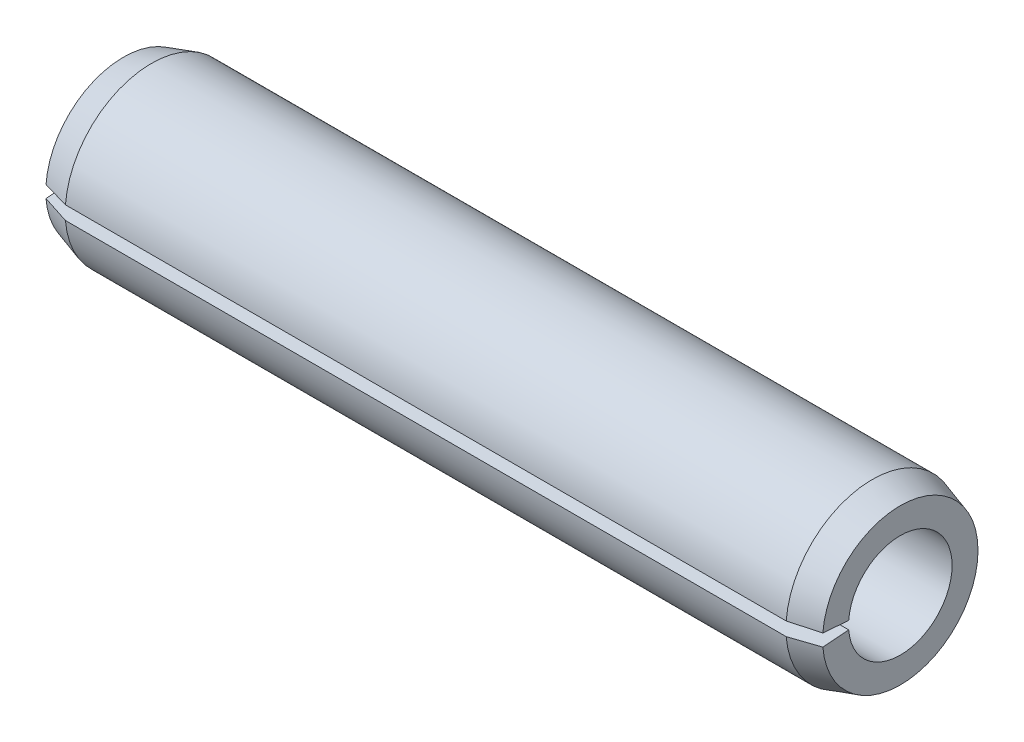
ISO-10303-21;
HEADER;
FILE_DESCRIPTION(('STEP AP214'),'2;1');
FILE_NAME('part.step','',(''),(''),'','','');
FILE_SCHEMA(('AUTOMOTIVE_DESIGN { 1 0 10303 214 1 1 1 1 }'));
ENDSEC;
DATA;
#1=APPLICATION_CONTEXT('core data for automotive mechanical design processes');
#2=APPLICATION_PROTOCOL_DEFINITION('international standard','automotive_design',2000,#1);
#3=PRODUCT_CONTEXT('',#1,'mechanical');
#4=PRODUCT('Part','Part','',(#3));
#5=PRODUCT_RELATED_PRODUCT_CATEGORY('part','',(#4));
#6=PRODUCT_DEFINITION_FORMATION('','',#4);
#7=PRODUCT_DEFINITION_CONTEXT('part definition',#1,'design');
#8=PRODUCT_DEFINITION('design','',#6,#7);
#9=PRODUCT_DEFINITION_SHAPE('','',#8);
#10=(LENGTH_UNIT() NAMED_UNIT(*) SI_UNIT(.MILLI.,.METRE.));
#11=(NAMED_UNIT(*) PLANE_ANGLE_UNIT() SI_UNIT($,.RADIAN.));
#12=(NAMED_UNIT(*) SI_UNIT($,.STERADIAN.) SOLID_ANGLE_UNIT());
#13=UNCERTAINTY_MEASURE_WITH_UNIT(LENGTH_MEASURE(1.E-05),#10,'distance_accuracy_value','');
#14=(GEOMETRIC_REPRESENTATION_CONTEXT(3) GLOBAL_UNCERTAINTY_ASSIGNED_CONTEXT((#13)) GLOBAL_UNIT_ASSIGNED_CONTEXT((#10,
#11,#12)) REPRESENTATION_CONTEXT('',''));
#15=CARTESIAN_POINT('',(0.,0.,0.));
#16=DIRECTION('',(0.,0.,1.));
#17=DIRECTION('',(1.,0.,0.));
#18=AXIS2_PLACEMENT_3D('',#15,#16,#17);
#19=CARTESIAN_POINT('',(0.,1.8,0.));
#20=DIRECTION('',(1.,0.,0.));
#21=DIRECTION('',(0.,0.,-1.));
#22=AXIS2_PLACEMENT_3D('',#19,#20,#21);
#23=PLANE('',#22);
#24=DIRECTION('',(0.,0.0784590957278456,0.996917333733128));
#25=VECTOR('',#24,1.);
#26=CARTESIAN_POINT('',(0.,0.,0.));
#27=LINE('',#26,#25);
#28=CARTESIAN_POINT('',(0.,0.0941509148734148,1.19630080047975));
#29=VERTEX_POINT('',#28);
#30=CARTESIAN_POINT('',(0.,0.141226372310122,1.79445120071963));
#31=VERTEX_POINT('',#30);
#32=EDGE_CURVE('E81',#29,#31,#27,.T.);
#33=ORIENTED_EDGE('',*,*,#32,.T.);
#34=CARTESIAN_POINT('',(0.,0.,0.));
#35=DIRECTION('',(-1.,0.,0.));
#36=DIRECTION('',(0.,0.,1.));
#37=AXIS2_PLACEMENT_3D('',#34,#35,#36);
#38=CIRCLE('',#37,1.8);
#39=CARTESIAN_POINT('',(0.,-0.141226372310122,1.79445120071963));
#40=VERTEX_POINT('',#39);
#41=EDGE_CURVE('E99',#31,#40,#38,.T.);
#42=ORIENTED_EDGE('',*,*,#41,.T.);
#43=DIRECTION('',(0.,-0.0784590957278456,0.996917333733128));
#44=VECTOR('',#43,1.);
#45=CARTESIAN_POINT('',(0.,0.,0.));
#46=LINE('',#45,#44);
#47=CARTESIAN_POINT('',(0.,-0.0941509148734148,1.19630080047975));
#48=VERTEX_POINT('',#47);
#49=EDGE_CURVE('E53',#48,#40,#46,.T.);
#50=ORIENTED_EDGE('',*,*,#49,.F.);
#51=CARTESIAN_POINT('',(0.,0.,0.));
#52=DIRECTION('',(-1.,0.,0.));
#53=DIRECTION('',(0.,0.,1.));
#54=AXIS2_PLACEMENT_3D('',#51,#52,#53);
#55=CIRCLE('',#54,1.2);
#56=EDGE_CURVE('E96',#29,#48,#55,.T.);
#57=ORIENTED_EDGE('',*,*,#56,.F.);
#58=EDGE_LOOP('',(#33,#42,#50,#57));
#59=FACE_BOUND('',#58,.T.);
#60=ADVANCED_FACE('F32',(#59),#23,.F.);
#61=CARTESIAN_POINT('',(-9.52499999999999,0.,0.));
#62=DIRECTION('',(-1.,0.,0.));
#63=DIRECTION('',(0.,0.,1.));
#64=AXIS2_PLACEMENT_3D('',#61,#62,#63);
#65=CYLINDRICAL_SURFACE('',#64,1.2);
#66=DIRECTION('',(-1.,0.,0.));
#67=VECTOR('',#66,1.);
#68=CARTESIAN_POINT('',(-9.52499999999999,0.0941509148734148,1.19630080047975));
#69=LINE('',#68,#67);
#70=CARTESIAN_POINT('',(18.,0.0941509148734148,1.19630080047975));
#71=VERTEX_POINT('',#70);
#72=EDGE_CURVE('E84',#29,#71,#69,.F.);
#73=ORIENTED_EDGE('',*,*,#72,.F.);
#74=ORIENTED_EDGE('',*,*,#56,.T.);
#75=DIRECTION('',(-1.,0.,0.));
#76=VECTOR('',#75,1.);
#77=CARTESIAN_POINT('',(-9.52499999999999,-0.0941509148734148,1.19630080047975));
#78=LINE('',#77,#76);
#79=CARTESIAN_POINT('',(18.,-0.0941509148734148,1.19630080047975));
#80=VERTEX_POINT('',#79);
#81=EDGE_CURVE('E117',#48,#80,#78,.F.);
#82=ORIENTED_EDGE('',*,*,#81,.T.);
#83=CARTESIAN_POINT('',(18.,0.,0.));
#84=DIRECTION('',(-1.,0.,0.));
#85=DIRECTION('',(0.,0.,1.));
#86=AXIS2_PLACEMENT_3D('',#83,#84,#85);
#87=CIRCLE('',#86,1.2);
#88=EDGE_CURVE('E98',#71,#80,#87,.T.);
#89=ORIENTED_EDGE('',*,*,#88,.F.);
#90=EDGE_LOOP('',(#73,#74,#82,#89));
#91=FACE_BOUND('',#90,.T.);
#92=ADVANCED_FACE('F94',(#91),#65,.F.);
#93=CARTESIAN_POINT('',(18.,1.2,0.));
#94=DIRECTION('',(-1.,0.,0.));
#95=DIRECTION('',(0.,0.,1.));
#96=AXIS2_PLACEMENT_3D('',#93,#94,#95);
#97=PLANE('',#96);
#98=DIRECTION('',(0.,0.0784590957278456,0.996917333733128));
#99=VECTOR('',#98,1.);
#100=CARTESIAN_POINT('',(18.,0.,0.));
#101=LINE('',#100,#99);
#102=CARTESIAN_POINT('',(18.,0.141226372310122,1.79445120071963));
#103=VERTEX_POINT('',#102);
#104=EDGE_CURVE('E126',#71,#103,#101,.T.);
#105=ORIENTED_EDGE('',*,*,#104,.F.);
#106=ORIENTED_EDGE('',*,*,#88,.T.);
#107=DIRECTION('',(0.,-0.0784590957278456,0.996917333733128));
#108=VECTOR('',#107,1.);
#109=CARTESIAN_POINT('',(18.,0.,0.));
#110=LINE('',#109,#108);
#111=CARTESIAN_POINT('',(18.,-0.141226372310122,1.79445120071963));
#112=VERTEX_POINT('',#111);
#113=EDGE_CURVE('E125',#80,#112,#110,.T.);
#114=ORIENTED_EDGE('',*,*,#113,.T.);
#115=CARTESIAN_POINT('',(18.,0.,0.));
#116=DIRECTION('',(-1.,0.,0.));
#117=DIRECTION('',(0.,0.,1.));
#118=AXIS2_PLACEMENT_3D('',#115,#116,#117);
#119=CIRCLE('',#118,1.8);
#120=EDGE_CURVE('E103',#103,#112,#119,.T.);
#121=ORIENTED_EDGE('',*,*,#120,.F.);
#122=EDGE_LOOP('',(#105,#106,#114,#121));
#123=FACE_BOUND('',#122,.T.);
#124=ADVANCED_FACE('F136',(#123),#97,.F.);
#125=CARTESIAN_POINT('',(18.,0.,0.));
#126=DIRECTION('',(-1.,0.,0.));
#127=DIRECTION('',(0.,0.,1.));
#128=AXIS2_PLACEMENT_3D('',#125,#126,#127);
#129=CONICAL_SURFACE('',#128,1.8,0.29849893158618);
#130=DIRECTION('',(-0.95577900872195,0.0230737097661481,0.293179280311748));
#131=VECTOR('',#130,1.);
#132=CARTESIAN_POINT('',(23.85,0.,0.));
#133=LINE('',#132,#131);
#134=CARTESIAN_POINT('',(17.35,0.156918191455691,1.99383466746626));
#135=VERTEX_POINT('',#134);
#136=EDGE_CURVE('E100',#103,#135,#133,.T.);
#137=ORIENTED_EDGE('',*,*,#136,.F.);
#138=ORIENTED_EDGE('',*,*,#120,.T.);
#139=DIRECTION('',(-0.95577900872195,-0.0230737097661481,0.293179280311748));
#140=VECTOR('',#139,1.);
#141=CARTESIAN_POINT('',(23.85,0.,0.));
#142=LINE('',#141,#140);
#143=CARTESIAN_POINT('',(17.35,-0.156918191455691,1.99383466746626));
#144=VERTEX_POINT('',#143);
#145=EDGE_CURVE('E119',#112,#144,#142,.T.);
#146=ORIENTED_EDGE('',*,*,#145,.T.);
#147=CARTESIAN_POINT('',(17.35,0.,0.));
#148=DIRECTION('',(-1.,0.,0.));
#149=DIRECTION('',(0.,0.,1.));
#150=AXIS2_PLACEMENT_3D('',#147,#148,#149);
#151=CIRCLE('',#150,2.);
#152=EDGE_CURVE('E108',#135,#144,#151,.T.);
#153=ORIENTED_EDGE('',*,*,#152,.F.);
#154=EDGE_LOOP('',(#137,#138,#146,#153));
#155=FACE_BOUND('',#154,.T.);
#156=ADVANCED_FACE('F135',(#155),#129,.T.);
#157=CARTESIAN_POINT('',(-9.52499999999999,0.,0.));
#158=DIRECTION('',(-1.,0.,0.));
#159=DIRECTION('',(0.,0.,1.));
#160=AXIS2_PLACEMENT_3D('',#157,#158,#159);
#161=CYLINDRICAL_SURFACE('',#160,2.);
#162=DIRECTION('',(-1.,0.,0.));
#163=VECTOR('',#162,1.);
#164=CARTESIAN_POINT('',(-9.52499999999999,0.156918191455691,1.99383466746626));
#165=LINE('',#164,#163);
#166=CARTESIAN_POINT('',(0.65,0.156918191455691,1.99383466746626));
#167=VERTEX_POINT('',#166);
#168=EDGE_CURVE('E45',#135,#167,#165,.T.);
#169=ORIENTED_EDGE('',*,*,#168,.F.);
#170=ORIENTED_EDGE('',*,*,#152,.T.);
#171=DIRECTION('',(-1.,0.,0.));
#172=VECTOR('',#171,1.);
#173=CARTESIAN_POINT('',(-9.52499999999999,-0.156918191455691,1.99383466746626));
#174=LINE('',#173,#172);
#175=CARTESIAN_POINT('',(0.649999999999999,-0.156918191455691,1.99383466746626));
#176=VERTEX_POINT('',#175);
#177=EDGE_CURVE('E122',#144,#176,#174,.T.);
#178=ORIENTED_EDGE('',*,*,#177,.T.);
#179=CARTESIAN_POINT('',(0.65,0.,0.));
#180=DIRECTION('',(-1.,0.,0.));
#181=DIRECTION('',(0.,0.,1.));
#182=AXIS2_PLACEMENT_3D('',#179,#180,#181);
#183=CIRCLE('',#182,2.);
#184=EDGE_CURVE('E111',#167,#176,#183,.T.);
#185=ORIENTED_EDGE('',*,*,#184,.F.);
#186=EDGE_LOOP('',(#169,#170,#178,#185));
#187=FACE_BOUND('',#186,.T.);
#188=ADVANCED_FACE('F139',(#187),#161,.T.);
#189=CARTESIAN_POINT('',(0.65,0.,0.));
#190=DIRECTION('',(1.,0.,0.));
#191=DIRECTION('',(0.,0.,-1.));
#192=AXIS2_PLACEMENT_3D('',#189,#190,#191);
#193=CONICAL_SURFACE('',#192,2.,0.29849893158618);
#194=DIRECTION('',(-0.95577900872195,-0.023073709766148,-0.293179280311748));
#195=VECTOR('',#194,1.);
#196=CARTESIAN_POINT('',(-5.84999999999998,0.,0.));
#197=LINE('',#196,#195);
#198=EDGE_CURVE('E11',#167,#31,#197,.T.);
#199=ORIENTED_EDGE('',*,*,#198,.F.);
#200=ORIENTED_EDGE('',*,*,#184,.T.);
#201=DIRECTION('',(-0.95577900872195,0.023073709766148,-0.293179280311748));
#202=VECTOR('',#201,1.);
#203=CARTESIAN_POINT('',(-5.84999999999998,0.,0.));
#204=LINE('',#203,#202);
#205=EDGE_CURVE('E39',#176,#40,#204,.T.);
#206=ORIENTED_EDGE('',*,*,#205,.T.);
#207=ORIENTED_EDGE('',*,*,#41,.F.);
#208=EDGE_LOOP('',(#199,#200,#206,#207));
#209=FACE_BOUND('',#208,.T.);
#210=ADVANCED_FACE('F142',(#209),#193,.T.);
#211=CARTESIAN_POINT('',(18.,0.,0.));
#212=DIRECTION('',(0.,-0.996917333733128,-0.0784590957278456));
#213=DIRECTION('',(0.,0.0784590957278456,-0.996917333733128));
#214=AXIS2_PLACEMENT_3D('',#211,#212,#213);
#215=PLANE('',#214);
#216=ORIENTED_EDGE('',*,*,#49,.T.);
#217=ORIENTED_EDGE('',*,*,#205,.F.);
#218=ORIENTED_EDGE('',*,*,#177,.F.);
#219=ORIENTED_EDGE('',*,*,#145,.F.);
#220=ORIENTED_EDGE('',*,*,#113,.F.);
#221=ORIENTED_EDGE('',*,*,#81,.F.);
#222=EDGE_LOOP('',(#216,#217,#218,#219,#220,#221));
#223=FACE_BOUND('',#222,.T.);
#224=ADVANCED_FACE('F137',(#223),#215,.F.);
#225=CARTESIAN_POINT('',(18.,0.,0.));
#226=DIRECTION('',(0.,-0.996917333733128,0.0784590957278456));
#227=DIRECTION('',(0.,-0.0784590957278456,-0.996917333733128));
#228=AXIS2_PLACEMENT_3D('',#225,#226,#227);
#229=PLANE('',#228);
#230=ORIENTED_EDGE('',*,*,#72,.T.);
#231=ORIENTED_EDGE('',*,*,#104,.T.);
#232=ORIENTED_EDGE('',*,*,#136,.T.);
#233=ORIENTED_EDGE('',*,*,#168,.T.);
#234=ORIENTED_EDGE('',*,*,#198,.T.);
#235=ORIENTED_EDGE('',*,*,#32,.F.);
#236=EDGE_LOOP('',(#230,#231,#232,#233,#234,#235));
#237=FACE_BOUND('',#236,.T.);
#238=ADVANCED_FACE('F83',(#237),#229,.T.);
#239=CLOSED_SHELL('',(#60,#92,#124,#156,#188,#210,#224,#238));
#240=MANIFOLD_SOLID_BREP('B2',#239);
#241=ADVANCED_BREP_SHAPE_REPRESENTATION('',(#18,#240),#14);
#242=SHAPE_DEFINITION_REPRESENTATION(#9,#241);
ENDSEC;
END-ISO-10303-21;
